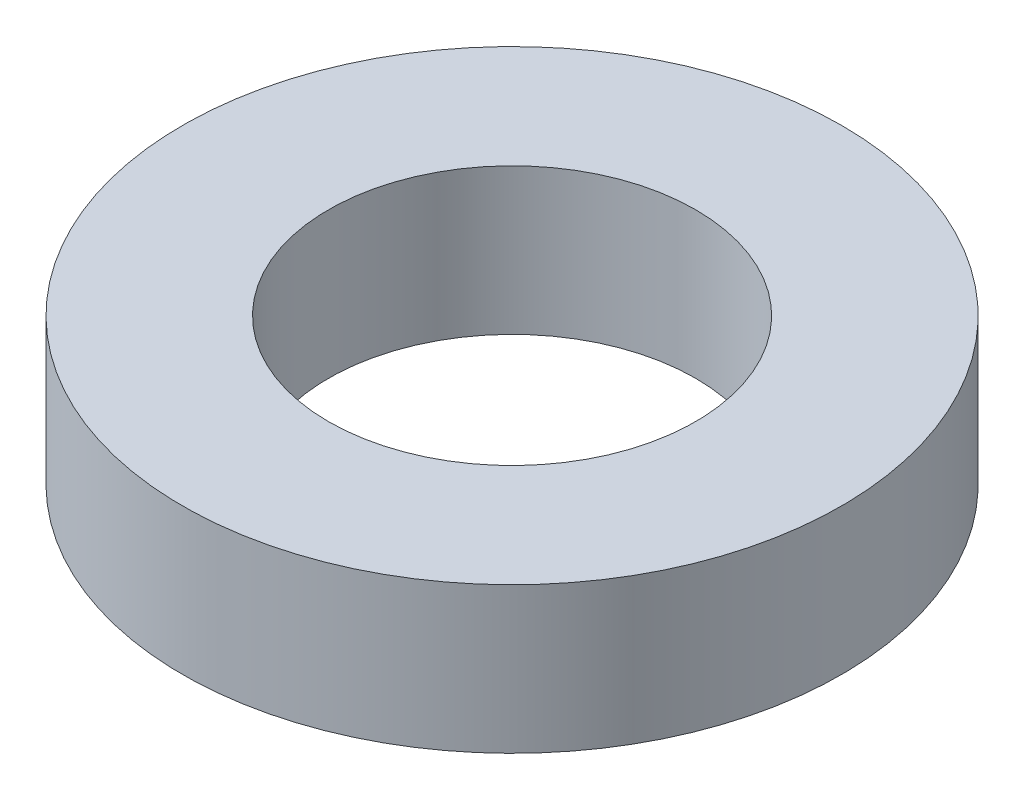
from build123d import *

# Parameters (mm, degrees)
SKETCH1_W = 1.778
SKETCH1_H = 1.778


with BuildPart() as part:
    # Sketch1 → Revolve1 (revolve)
    with BuildSketch(Plane.XY, mode=Mode.PRIVATE) as revolve1_sk:
        with Locations((-3.1242, 0.889)):
            Rectangle(SKETCH1_W, SKETCH1_H)
    revolve(revolve1_sk.sketch.rotate(Axis((0, 0, 0), (0, 1, 0)), 270), axis=Axis((0, 0, 0), (0, 1, 0)))


solid = part.part
